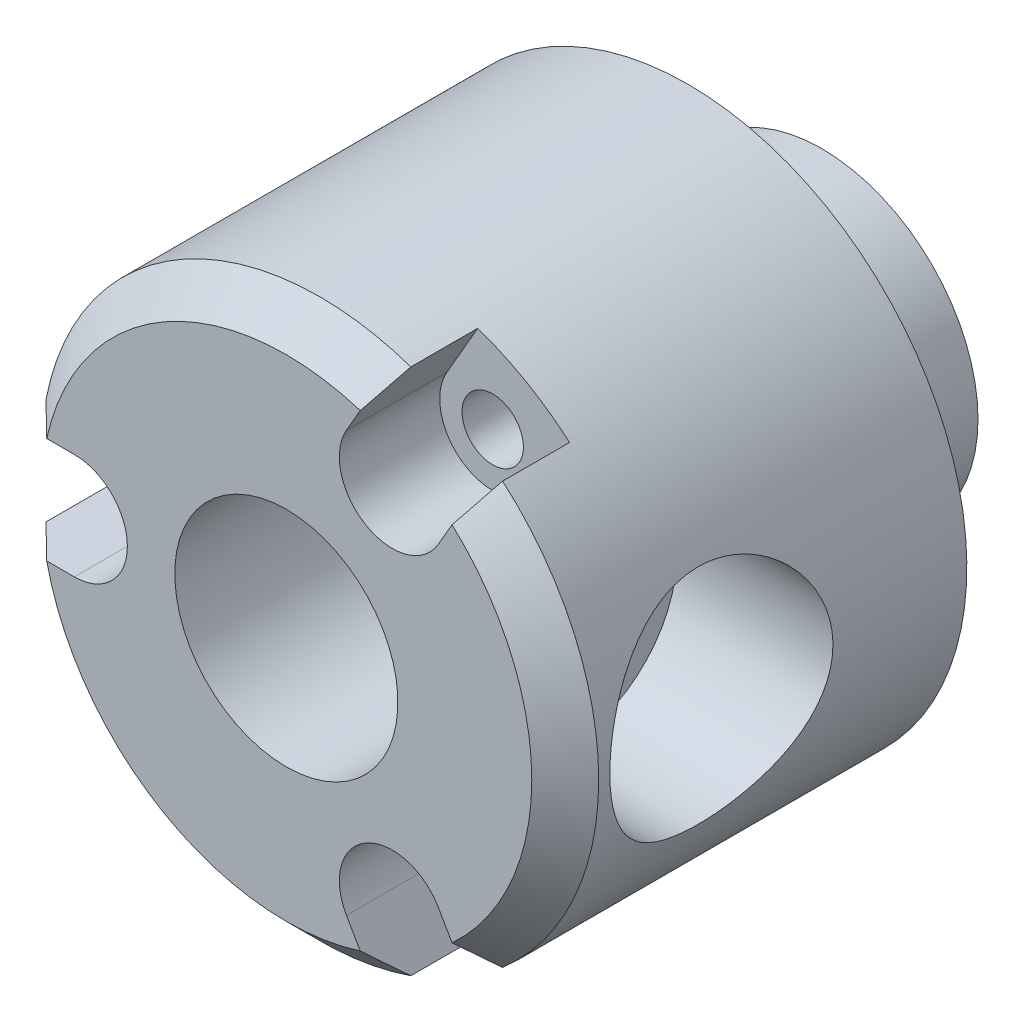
ISO-10303-21;
HEADER;
FILE_DESCRIPTION(('STEP AP214'),'2;1');
FILE_NAME('part.step','',(''),(''),'','','');
FILE_SCHEMA(('AUTOMOTIVE_DESIGN { 1 0 10303 214 1 1 1 1 }'));
ENDSEC;
DATA;
#1=APPLICATION_CONTEXT('core data for automotive mechanical design processes');
#2=APPLICATION_PROTOCOL_DEFINITION('international standard','automotive_design',2000,#1);
#3=PRODUCT_CONTEXT('',#1,'mechanical');
#4=PRODUCT('Part','Part','',(#3));
#5=PRODUCT_RELATED_PRODUCT_CATEGORY('part','',(#4));
#6=PRODUCT_DEFINITION_FORMATION('','',#4);
#7=PRODUCT_DEFINITION_CONTEXT('part definition',#1,'design');
#8=PRODUCT_DEFINITION('design','',#6,#7);
#9=PRODUCT_DEFINITION_SHAPE('','',#8);
#10=(LENGTH_UNIT() NAMED_UNIT(*) SI_UNIT(.MILLI.,.METRE.));
#11=(NAMED_UNIT(*) PLANE_ANGLE_UNIT() SI_UNIT($,.RADIAN.));
#12=(NAMED_UNIT(*) SI_UNIT($,.STERADIAN.) SOLID_ANGLE_UNIT());
#13=UNCERTAINTY_MEASURE_WITH_UNIT(LENGTH_MEASURE(1.E-05),#10,'distance_accuracy_value','');
#14=(GEOMETRIC_REPRESENTATION_CONTEXT(3) GLOBAL_UNCERTAINTY_ASSIGNED_CONTEXT((#13)) GLOBAL_UNIT_ASSIGNED_CONTEXT((#10,
#11,#12)) REPRESENTATION_CONTEXT('',''));
#15=CARTESIAN_POINT('',(0.,0.,0.));
#16=DIRECTION('',(0.,0.,1.));
#17=DIRECTION('',(1.,0.,0.));
#18=AXIS2_PLACEMENT_3D('',#15,#16,#17);
#19=CARTESIAN_POINT('',(9.49999999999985,-16.4544826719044,36.));
#20=DIRECTION('',(0.,0.,1.));
#21=DIRECTION('',(0.,-1.,0.));
#22=AXIS2_PLACEMENT_3D('',#19,#20,#21);
#23=CYLINDRICAL_SURFACE('',#22,4.75);
#24=DIRECTION('',(0.,0.,1.));
#25=VECTOR('',#24,1.);
#26=CARTESIAN_POINT('',(13.6136206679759,-14.0794826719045,27.));
#27=LINE('',#26,#25);
#28=CARTESIAN_POINT('',(13.6136206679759,-14.0794826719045,27.));
#29=VERTEX_POINT('',#28);
#30=CARTESIAN_POINT('',(13.6136206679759,-14.0794826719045,36.));
#31=VERTEX_POINT('',#30);
#32=EDGE_CURVE('E407',#29,#31,#27,.T.);
#33=ORIENTED_EDGE('',*,*,#32,.T.);
#34=CARTESIAN_POINT('',(9.49999999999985,-16.4544826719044,36.));
#35=DIRECTION('',(0.,0.,1.));
#36=DIRECTION('',(0.,-1.,0.));
#37=AXIS2_PLACEMENT_3D('',#34,#35,#36);
#38=CIRCLE('',#37,4.75);
#39=CARTESIAN_POINT('',(5.38637933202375,-18.8294826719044,36.));
#40=VERTEX_POINT('',#39);
#41=EDGE_CURVE('E186',#31,#40,#38,.T.);
#42=ORIENTED_EDGE('',*,*,#41,.T.);
#43=DIRECTION('',(0.,0.,1.));
#44=VECTOR('',#43,1.);
#45=CARTESIAN_POINT('',(5.38637933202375,-18.8294826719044,27.));
#46=LINE('',#45,#44);
#47=CARTESIAN_POINT('',(5.38637933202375,-18.8294826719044,27.));
#48=VERTEX_POINT('',#47);
#49=EDGE_CURVE('E409',#48,#40,#46,.T.);
#50=ORIENTED_EDGE('',*,*,#49,.F.);
#51=CARTESIAN_POINT('',(9.49999999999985,-16.4544826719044,27.));
#52=DIRECTION('',(0.,0.,1.));
#53=DIRECTION('',(0.,-1.,0.));
#54=AXIS2_PLACEMENT_3D('',#51,#52,#53);
#55=CIRCLE('',#54,4.75);
#56=EDGE_CURVE('E183',#29,#48,#55,.T.);
#57=ORIENTED_EDGE('',*,*,#56,.F.);
#58=EDGE_LOOP('',(#33,#42,#50,#57));
#59=FACE_BOUND('',#58,.T.);
#60=ADVANCED_FACE('F14',(#59),#23,.F.);
#61=CARTESIAN_POINT('',(9.5,16.4544826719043,36.));
#62=DIRECTION('',(0.,0.,1.));
#63=DIRECTION('',(0.,-1.,0.));
#64=AXIS2_PLACEMENT_3D('',#61,#62,#63);
#65=CYLINDRICAL_SURFACE('',#64,4.75);
#66=DIRECTION('',(0.,0.,1.));
#67=VECTOR('',#66,1.);
#68=CARTESIAN_POINT('',(5.38637933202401,18.8294826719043,27.));
#69=LINE('',#68,#67);
#70=CARTESIAN_POINT('',(5.38637933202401,18.8294826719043,27.));
#71=VERTEX_POINT('',#70);
#72=CARTESIAN_POINT('',(5.38637933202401,18.8294826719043,36.));
#73=VERTEX_POINT('',#72);
#74=EDGE_CURVE('E433',#71,#73,#69,.T.);
#75=ORIENTED_EDGE('',*,*,#74,.T.);
#76=CARTESIAN_POINT('',(9.5,16.4544826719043,36.));
#77=DIRECTION('',(0.,0.,1.));
#78=DIRECTION('',(0.,-1.,0.));
#79=AXIS2_PLACEMENT_3D('',#76,#77,#78);
#80=CIRCLE('',#79,4.75);
#81=CARTESIAN_POINT('',(13.6136206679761,14.0794826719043,36.));
#82=VERTEX_POINT('',#81);
#83=EDGE_CURVE('E196',#73,#82,#80,.T.);
#84=ORIENTED_EDGE('',*,*,#83,.T.);
#85=DIRECTION('',(0.,0.,1.));
#86=VECTOR('',#85,1.);
#87=CARTESIAN_POINT('',(13.6136206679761,14.0794826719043,27.));
#88=LINE('',#87,#86);
#89=CARTESIAN_POINT('',(13.6136206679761,14.0794826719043,27.));
#90=VERTEX_POINT('',#89);
#91=EDGE_CURVE('E432',#90,#82,#88,.T.);
#92=ORIENTED_EDGE('',*,*,#91,.F.);
#93=CARTESIAN_POINT('',(9.5,16.4544826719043,27.));
#94=DIRECTION('',(0.,0.,1.));
#95=DIRECTION('',(0.,-1.,0.));
#96=AXIS2_PLACEMENT_3D('',#93,#94,#95);
#97=CIRCLE('',#96,4.75);
#98=EDGE_CURVE('E193',#71,#90,#97,.T.);
#99=ORIENTED_EDGE('',*,*,#98,.F.);
#100=EDGE_LOOP('',(#75,#84,#92,#99));
#101=FACE_BOUND('',#100,.T.);
#102=ADVANCED_FACE('F284',(#101),#65,.F.);
#103=CARTESIAN_POINT('',(-19.,0.,36.));
#104=DIRECTION('',(0.,0.,1.));
#105=DIRECTION('',(0.,-1.,0.));
#106=AXIS2_PLACEMENT_3D('',#103,#104,#105);
#107=CYLINDRICAL_SURFACE('',#106,4.75);
#108=DIRECTION('',(0.,0.,1.));
#109=VECTOR('',#108,1.);
#110=CARTESIAN_POINT('',(-19.,-4.75,27.));
#111=LINE('',#110,#109);
#112=CARTESIAN_POINT('',(-19.,-4.75,27.));
#113=VERTEX_POINT('',#112);
#114=CARTESIAN_POINT('',(-19.,-4.75,36.));
#115=VERTEX_POINT('',#114);
#116=EDGE_CURVE('E170',#113,#115,#111,.T.);
#117=ORIENTED_EDGE('',*,*,#116,.T.);
#118=CARTESIAN_POINT('',(-19.,0.,36.));
#119=DIRECTION('',(0.,0.,1.));
#120=DIRECTION('',(0.,-1.,0.));
#121=AXIS2_PLACEMENT_3D('',#118,#119,#120);
#122=CIRCLE('',#121,4.75);
#123=CARTESIAN_POINT('',(-19.,4.75,36.));
#124=VERTEX_POINT('',#123);
#125=EDGE_CURVE('E206',#115,#124,#122,.T.);
#126=ORIENTED_EDGE('',*,*,#125,.T.);
#127=DIRECTION('',(0.,0.,1.));
#128=VECTOR('',#127,1.);
#129=CARTESIAN_POINT('',(-19.,4.75,27.));
#130=LINE('',#129,#128);
#131=CARTESIAN_POINT('',(-19.,4.75,27.));
#132=VERTEX_POINT('',#131);
#133=EDGE_CURVE('E169',#132,#124,#130,.T.);
#134=ORIENTED_EDGE('',*,*,#133,.F.);
#135=CARTESIAN_POINT('',(-19.,0.,27.));
#136=DIRECTION('',(0.,0.,1.));
#137=DIRECTION('',(0.,-1.,0.));
#138=AXIS2_PLACEMENT_3D('',#135,#136,#137);
#139=CIRCLE('',#138,4.75);
#140=EDGE_CURVE('E203',#113,#132,#139,.T.);
#141=ORIENTED_EDGE('',*,*,#140,.F.);
#142=EDGE_LOOP('',(#117,#126,#134,#141));
#143=FACE_BOUND('',#142,.T.);
#144=ADVANCED_FACE('F280',(#143),#107,.F.);
#145=CARTESIAN_POINT('',(0.,0.,0.));
#146=DIRECTION('',(0.,0.,-1.));
#147=DIRECTION('',(0.,1.,0.));
#148=AXIS2_PLACEMENT_3D('',#145,#146,#147);
#149=CYLINDRICAL_SURFACE('',#148,25.);
#150=CARTESIAN_POINT('',(0.,0.,33.));
#151=DIRECTION('',(0.,0.,-1.));
#152=DIRECTION('',(0.,1.,0.));
#153=AXIS2_PLACEMENT_3D('',#150,#151,#152);
#154=CIRCLE('',#153,25.);
#155=CARTESIAN_POINT('',(8.15868046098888,-23.6312490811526,33.));
#156=VERTEX_POINT('',#155);
#157=CARTESIAN_POINT('',(-24.5446022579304,-4.75,33.));
#158=VERTEX_POINT('',#157);
#159=EDGE_CURVE('E145',#156,#158,#154,.T.);
#160=ORIENTED_EDGE('',*,*,#159,.T.);
#161=DIRECTION('',(0.,0.,-1.));
#162=VECTOR('',#161,1.);
#163=CARTESIAN_POINT('',(-24.5446022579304,-4.75,0.));
#164=LINE('',#163,#162);
#165=CARTESIAN_POINT('',(-24.5446022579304,-4.75,27.));
#166=VERTEX_POINT('',#165);
#167=EDGE_CURVE('E177',#166,#158,#164,.F.);
#168=ORIENTED_EDGE('',*,*,#167,.F.);
#169=CARTESIAN_POINT('',(0.,0.,27.));
#170=DIRECTION('',(0.,0.,1.));
#171=DIRECTION('',(0.,-1.,0.));
#172=AXIS2_PLACEMENT_3D('',#169,#170,#171);
#173=CIRCLE('',#172,25.);
#174=CARTESIAN_POINT('',(-24.5446022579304,4.75,27.));
#175=VERTEX_POINT('',#174);
#176=EDGE_CURVE('E173',#166,#175,#173,.F.);
#177=ORIENTED_EDGE('',*,*,#176,.T.);
#178=DIRECTION('',(0.,0.,-1.));
#179=VECTOR('',#178,1.);
#180=CARTESIAN_POINT('',(-24.5446022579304,4.75,0.));
#181=LINE('',#180,#179);
#182=CARTESIAN_POINT('',(-24.5446022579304,4.75,33.));
#183=VERTEX_POINT('',#182);
#184=EDGE_CURVE('E144',#183,#175,#181,.T.);
#185=ORIENTED_EDGE('',*,*,#184,.F.);
#186=CARTESIAN_POINT('',(8.15868046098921,23.6312490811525,33.));
#187=VERTEX_POINT('',#186);
#188=EDGE_CURVE('E128',#183,#187,#154,.T.);
#189=ORIENTED_EDGE('',*,*,#188,.T.);
#190=DIRECTION('',(0.,0.,-1.));
#191=VECTOR('',#190,1.);
#192=CARTESIAN_POINT('',(8.15868046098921,23.6312490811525,0.));
#193=LINE('',#192,#191);
#194=CARTESIAN_POINT('',(8.15868046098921,23.6312490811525,27.));
#195=VERTEX_POINT('',#194);
#196=EDGE_CURVE('E142',#195,#187,#193,.F.);
#197=ORIENTED_EDGE('',*,*,#196,.F.);
#198=CARTESIAN_POINT('',(0.,0.,27.));
#199=DIRECTION('',(0.,0.,1.));
#200=DIRECTION('',(0.,-1.,0.));
#201=AXIS2_PLACEMENT_3D('',#198,#199,#200);
#202=CIRCLE('',#201,25.);
#203=CARTESIAN_POINT('',(16.3859217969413,18.8812490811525,27.));
#204=VERTEX_POINT('',#203);
#205=EDGE_CURVE('E158',#195,#204,#202,.F.);
#206=ORIENTED_EDGE('',*,*,#205,.T.);
#207=DIRECTION('',(0.,0.,-1.));
#208=VECTOR('',#207,1.);
#209=CARTESIAN_POINT('',(16.3859217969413,18.8812490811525,0.));
#210=LINE('',#209,#208);
#211=CARTESIAN_POINT('',(16.3859217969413,18.8812490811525,33.));
#212=VERTEX_POINT('',#211);
#213=EDGE_CURVE('E153',#212,#204,#210,.T.);
#214=ORIENTED_EDGE('',*,*,#213,.F.);
#215=CARTESIAN_POINT('',(16.3859217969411,-18.8812490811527,33.));
#216=VERTEX_POINT('',#215);
#217=EDGE_CURVE('E147',#212,#216,#154,.T.);
#218=ORIENTED_EDGE('',*,*,#217,.T.);
#219=DIRECTION('',(0.,0.,-1.));
#220=VECTOR('',#219,1.);
#221=CARTESIAN_POINT('',(16.3859217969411,-18.8812490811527,0.));
#222=LINE('',#221,#220);
#223=CARTESIAN_POINT('',(16.3859217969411,-18.8812490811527,27.));
#224=VERTEX_POINT('',#223);
#225=EDGE_CURVE('E420',#224,#216,#222,.F.);
#226=ORIENTED_EDGE('',*,*,#225,.F.);
#227=CARTESIAN_POINT('',(0.,0.,27.));
#228=DIRECTION('',(0.,0.,1.));
#229=DIRECTION('',(0.,-1.,0.));
#230=AXIS2_PLACEMENT_3D('',#227,#228,#229);
#231=CIRCLE('',#230,25.);
#232=CARTESIAN_POINT('',(8.15868046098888,-23.6312490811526,27.));
#233=VERTEX_POINT('',#232);
#234=EDGE_CURVE('E414',#224,#233,#231,.F.);
#235=ORIENTED_EDGE('',*,*,#234,.T.);
#236=DIRECTION('',(0.,0.,-1.));
#237=VECTOR('',#236,1.);
#238=CARTESIAN_POINT('',(8.15868046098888,-23.6312490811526,0.));
#239=LINE('',#238,#237);
#240=EDGE_CURVE('E335',#156,#233,#239,.T.);
#241=ORIENTED_EDGE('',*,*,#240,.F.);
#242=EDGE_LOOP('',(#160,#168,#177,#185,#189,#197,#206,#214,#218,#226,#235,#241));
#243=FACE_BOUND('',#242,.T.);
#244=CARTESIAN_POINT('',(22.9128784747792,10.,22.));
#245=CARTESIAN_POINT('',(22.9128805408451,9.99999793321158,22.2679432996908));
#246=CARTESIAN_POINT('',(22.9175942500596,9.98921628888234,22.5359684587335));
#247=CARTESIAN_POINT('',(22.9362975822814,9.94619451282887,23.0700814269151));
#248=CARTESIAN_POINT('',(22.9502928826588,9.9139412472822,23.3361679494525));
#249=CARTESIAN_POINT('',(22.9871287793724,9.82822912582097,23.8648801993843));
#250=CARTESIAN_POINT('',(23.0099884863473,9.77472444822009,24.1274971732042));
#251=CARTESIAN_POINT('',(23.0638014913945,9.64706427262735,24.6468219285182));
#252=CARTESIAN_POINT('',(23.0947554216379,9.57290716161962,24.9035292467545));
#253=CARTESIAN_POINT('',(23.1636467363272,9.40498076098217,25.4083461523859));
#254=CARTESIAN_POINT('',(23.2015565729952,9.31128864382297,25.6564852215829));
#255=CARTESIAN_POINT('',(23.2833138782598,9.10492212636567,26.14371867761));
#256=CARTESIAN_POINT('',(23.3271615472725,8.99224708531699,26.3828127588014));
#257=CARTESIAN_POINT('',(23.4195445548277,8.74882020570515,26.8505252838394));
#258=CARTESIAN_POINT('',(23.468077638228,8.6180770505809,27.0791486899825));
#259=CARTESIAN_POINT('',(23.5685622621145,8.33935515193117,27.5248832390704));
#260=CARTESIAN_POINT('',(23.6205150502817,8.19137010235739,27.7419901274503));
#261=CARTESIAN_POINT('',(23.7849852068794,7.70678893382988,28.3960438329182));
#262=CARTESIAN_POINT('',(23.9011684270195,7.34201789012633,28.8116724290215));
#263=CARTESIAN_POINT('',(24.1306503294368,6.54842438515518,29.5777547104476));
#264=CARTESIAN_POINT('',(24.2439479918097,6.11957963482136,29.9281856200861));
#265=CARTESIAN_POINT('',(24.4050933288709,5.42687385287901,30.4042811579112));
#266=CARTESIAN_POINT('',(24.458266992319,5.18254798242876,30.5571298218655));
#267=CARTESIAN_POINT('',(24.5592227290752,4.68080345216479,30.8415568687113));
#268=CARTESIAN_POINT('',(24.6070070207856,4.42339024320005,30.9731440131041));
#269=CARTESIAN_POINT('',(24.6958115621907,3.89719145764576,31.2138821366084));
#270=CARTESIAN_POINT('',(24.7368324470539,3.62840695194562,31.3230352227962));
#271=CARTESIAN_POINT('',(24.8109091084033,3.0813849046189,31.5178430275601));
#272=CARTESIAN_POINT('',(24.8439653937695,2.80314796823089,31.6034992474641));
#273=CARTESIAN_POINT('',(24.8997281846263,2.25304981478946,31.746825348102));
#274=CARTESIAN_POINT('',(24.9228582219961,1.98153191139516,31.8056492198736));
#275=CARTESIAN_POINT('',(24.9603502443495,1.43394947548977,31.9005550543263));
#276=CARTESIAN_POINT('',(24.9747124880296,1.15788507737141,31.9366376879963));
#277=CARTESIAN_POINT('',(24.9942540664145,0.60347278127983,31.9856518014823));
#278=CARTESIAN_POINT('',(24.9994363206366,0.325125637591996,31.998590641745));
#279=CARTESIAN_POINT('',(25.0004763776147,-0.231690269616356,32.0011911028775));
#280=CARTESIAN_POINT('',(24.9963345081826,-0.510159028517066,31.9908535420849));
#281=CARTESIAN_POINT('',(24.9793412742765,-1.04935083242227,31.9482580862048));
#282=CARTESIAN_POINT('',(24.9669929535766,-1.31019093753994,31.9172659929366));
#283=CARTESIAN_POINT('',(24.9344189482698,-1.82813508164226,31.8349721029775));
#284=CARTESIAN_POINT('',(24.9141936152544,-2.0852392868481,31.783671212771));
#285=CARTESIAN_POINT('',(24.8663734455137,-2.59398534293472,31.6612473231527));
#286=CARTESIAN_POINT('',(24.8387783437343,-2.84562699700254,31.590123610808));
#287=CARTESIAN_POINT('',(24.77689814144,-3.34183184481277,31.4286921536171));
#288=CARTESIAN_POINT('',(24.7426128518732,-3.58639483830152,31.3383838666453));
#289=CARTESIAN_POINT('',(24.667623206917,-4.07053573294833,31.1378557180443));
#290=CARTESIAN_POINT('',(24.6268311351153,-4.30998577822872,31.0273602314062));
#291=CARTESIAN_POINT('',(24.5401737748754,-4.77877806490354,30.7882052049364));
#292=CARTESIAN_POINT('',(24.494306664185,-5.00811663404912,30.6595391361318));
#293=CARTESIAN_POINT('',(24.3985896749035,-5.45537645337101,30.3849706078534));
#294=CARTESIAN_POINT('',(24.3487394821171,-5.67329680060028,30.2390667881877));
#295=CARTESIAN_POINT('',(24.2462149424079,-6.09659718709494,29.9309547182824));
#296=CARTESIAN_POINT('',(24.1935403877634,-6.30197630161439,29.7687452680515));
#297=CARTESIAN_POINT('',(24.0830694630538,-6.71221301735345,29.4178004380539));
#298=CARTESIAN_POINT('',(24.0251639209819,-6.9161504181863,29.2280225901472));
#299=CARTESIAN_POINT('',(23.9090514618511,-7.30745656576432,28.8321695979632));
#300=CARTESIAN_POINT('',(23.8508445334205,-7.49482468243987,28.6260938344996));
#301=CARTESIAN_POINT('',(23.7356723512,-7.8519473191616,28.1987488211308));
#302=CARTESIAN_POINT('',(23.6787075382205,-8.02169566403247,27.9774742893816));
#303=CARTESIAN_POINT('',(23.5676251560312,-8.34241283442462,27.5210453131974));
#304=CARTESIAN_POINT('',(23.513507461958,-8.49338248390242,27.2858914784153));
#305=CARTESIAN_POINT('',(23.4082017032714,-8.77952196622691,26.7961140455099));
#306=CARTESIAN_POINT('',(23.3571417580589,-8.91411616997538,26.541125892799));
#307=CARTESIAN_POINT('',(23.2613739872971,-9.16111521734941,26.0195989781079));
#308=CARTESIAN_POINT('',(23.2166634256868,-9.27352962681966,25.7530652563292));
#309=CARTESIAN_POINT('',(23.135121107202,-9.4751255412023,25.2102622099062));
#310=CARTESIAN_POINT('',(23.0982869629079,-9.56431408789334,24.9339958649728));
#311=CARTESIAN_POINT('',(23.0338295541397,-9.71852350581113,24.373750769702));
#312=CARTESIAN_POINT('',(23.0062055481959,-9.78354632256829,24.0897726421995));
#313=CARTESIAN_POINT('',(22.9626006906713,-9.88543600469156,23.5339616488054));
#314=CARTESIAN_POINT('',(22.9460115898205,-9.9237804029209,23.2624467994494));
#315=CARTESIAN_POINT('',(22.9224667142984,-9.97804609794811,22.7167707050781));
#316=CARTESIAN_POINT('',(22.9155105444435,-9.99396831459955,22.4426095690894));
#317=CARTESIAN_POINT('',(22.9114819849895,-10.003200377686,21.8939083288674));
#318=CARTESIAN_POINT('',(22.9144069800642,-9.99651620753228,21.6193683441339));
#319=CARTESIAN_POINT('',(22.9300298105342,-9.96062826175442,21.0720505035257));
#320=CARTESIAN_POINT('',(22.9427273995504,-9.93142505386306,20.7992726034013));
#321=CARTESIAN_POINT('',(22.9764462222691,-9.85315233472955,20.2731445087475));
#322=CARTESIAN_POINT('',(22.9969492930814,-9.80531592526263,20.0195761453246));
#323=CARTESIAN_POINT('',(23.0456142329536,-9.69038472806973,19.517503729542));
#324=CARTESIAN_POINT('',(23.0737787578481,-9.62328326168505,19.2690014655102));
#325=CARTESIAN_POINT('',(23.1369260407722,-9.47045293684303,18.7787520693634));
#326=CARTESIAN_POINT('',(23.1719073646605,-9.3847279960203,18.5370035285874));
#327=CARTESIAN_POINT('',(23.2477235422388,-9.19531146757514,18.0615011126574));
#328=CARTESIAN_POINT('',(23.2885606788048,-9.09161286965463,17.8277503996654));
#329=CARTESIAN_POINT('',(23.3767257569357,-8.86252494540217,17.3603803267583));
#330=CARTESIAN_POINT('',(23.4242483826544,-8.73643228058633,17.1271425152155));
#331=CARTESIAN_POINT('',(23.5231622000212,-8.46649303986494,16.6719084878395));
#332=CARTESIAN_POINT('',(23.5745550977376,-8.3226386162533,16.4499173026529));
#333=CARTESIAN_POINT('',(23.6798634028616,-8.01810592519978,16.0183843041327));
#334=CARTESIAN_POINT('',(23.7337791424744,-7.85742543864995,15.8088441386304));
#335=CARTESIAN_POINT('',(23.8427852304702,-7.52017263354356,15.4032913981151));
#336=CARTESIAN_POINT('',(23.8978756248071,-7.34359969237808,15.207279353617));
#337=CARTESIAN_POINT('',(24.0119837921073,-6.96183884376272,14.8157821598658));
#338=CARTESIAN_POINT('',(24.0709898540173,-6.75549995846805,14.6214139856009));
#339=CARTESIAN_POINT('',(24.1871909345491,-6.32685407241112,14.2507304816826));
#340=CARTESIAN_POINT('',(24.2443865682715,-6.10455258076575,14.0744089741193));
#341=CARTESIAN_POINT('',(24.3554653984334,-5.64510225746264,13.7408571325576));
#342=CARTESIAN_POINT('',(24.4093470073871,-5.40794641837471,13.5836359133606));
#343=CARTESIAN_POINT('',(24.512272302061,-4.92042054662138,13.2896353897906));
#344=CARTESIAN_POINT('',(24.5613180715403,-4.67005627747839,13.1528472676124));
#345=CARTESIAN_POINT('',(24.6532357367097,-4.15761008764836,12.9007796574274));
#346=CARTESIAN_POINT('',(24.6961073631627,-3.89552765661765,12.7855011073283));
#347=CARTESIAN_POINT('',(24.7744510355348,-3.3614587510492,12.577542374));
#348=CARTESIAN_POINT('',(24.8099230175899,-3.08947219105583,12.4848623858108));
#349=CARTESIAN_POINT('',(24.8724119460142,-2.53774672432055,12.3230974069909));
#350=CARTESIAN_POINT('',(24.8994326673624,-2.25801133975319,12.2540018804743));
#351=CARTESIAN_POINT('',(24.9442251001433,-1.69291011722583,12.1401260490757));
#352=CARTESIAN_POINT('',(24.9619974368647,-1.40754466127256,12.0953441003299));
#353=CARTESIAN_POINT('',(24.9869097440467,-0.852327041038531,12.0327326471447));
#354=CARTESIAN_POINT('',(24.9946681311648,-0.582678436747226,12.0133343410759));
#355=CARTESIAN_POINT('',(25.0014220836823,-0.0425920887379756,11.996442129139));
#356=CARTESIAN_POINT('',(25.0004180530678,0.227845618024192,11.998947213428));
#357=CARTESIAN_POINT('',(24.9896755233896,0.767415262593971,12.0258317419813));
#358=CARTESIAN_POINT('',(24.9799382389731,1.03654737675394,12.0502081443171));
#359=CARTESIAN_POINT('',(24.9519951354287,1.5715226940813,12.1205717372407));
#360=CARTESIAN_POINT('',(24.9337893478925,1.8373659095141,12.16655884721));
#361=CARTESIAN_POINT('',(24.8900859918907,2.35566546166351,12.2779161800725));
#362=CARTESIAN_POINT('',(24.8648318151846,2.60828137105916,12.3426417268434));
#363=CARTESIAN_POINT('',(24.8074428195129,3.1070604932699,12.4913762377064));
#364=CARTESIAN_POINT('',(24.7753055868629,3.35322140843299,12.5753919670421));
#365=CARTESIAN_POINT('',(24.7049318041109,3.83747450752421,12.761974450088));
#366=CARTESIAN_POINT('',(24.6666957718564,4.07556737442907,12.8645396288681));
#367=CARTESIAN_POINT('',(24.5850167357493,4.54236828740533,13.0874359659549));
#368=CARTESIAN_POINT('',(24.54157332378,4.77107559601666,13.2077685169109));
#369=CARTESIAN_POINT('',(24.4484634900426,5.2277440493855,13.4710382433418));
#370=CARTESIAN_POINT('',(24.3986069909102,5.45522634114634,13.614738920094));
#371=CARTESIAN_POINT('',(24.2955251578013,5.89737222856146,13.9195844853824));
#372=CARTESIAN_POINT('',(24.2422997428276,6.11203551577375,14.0807297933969));
#373=CARTESIAN_POINT('',(24.133751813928,6.52749120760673,14.4195165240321));
#374=CARTESIAN_POINT('',(24.0784285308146,6.72827844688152,14.5971640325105));
#375=CARTESIAN_POINT('',(23.967048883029,7.11484620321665,14.9678818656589));
#376=CARTESIAN_POINT('',(23.910992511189,7.30062657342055,15.1609523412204));
#377=CARTESIAN_POINT('',(23.7960585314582,7.6672528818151,15.5739482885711));
#378=CARTESIAN_POINT('',(23.7372222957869,7.84707327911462,15.7947971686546));
#379=CARTESIAN_POINT('',(23.6219835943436,8.18744004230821,16.251358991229));
#380=CARTESIAN_POINT('',(23.5655803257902,8.34799279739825,16.4870669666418));
#381=CARTESIAN_POINT('',(23.4568451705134,8.64881574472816,16.9721313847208));
#382=CARTESIAN_POINT('',(23.4045149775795,8.78907751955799,17.2214934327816));
#383=CARTESIAN_POINT('',(23.3056049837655,9.04809415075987,17.7322196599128));
#384=CARTESIAN_POINT('',(23.2590243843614,9.16685199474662,17.9935821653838));
#385=CARTESIAN_POINT('',(23.1770166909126,9.37213926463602,18.5026543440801));
#386=CARTESIAN_POINT('',(23.1409637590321,9.46060466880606,18.7494838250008));
#387=CARTESIAN_POINT('',(23.0759605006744,9.61807222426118,19.2501755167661));
#388=CARTESIAN_POINT('',(23.0470093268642,9.68707669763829,19.5040368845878));
#389=CARTESIAN_POINT('',(22.9971568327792,9.80483861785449,20.0165393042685));
#390=CARTESIAN_POINT('',(22.9762363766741,9.85364421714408,20.2751674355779));
#391=CARTESIAN_POINT('',(22.9430254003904,9.93072834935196,20.7959074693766));
#392=CARTESIAN_POINT('',(22.9307298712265,9.95901879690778,21.0580172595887));
#393=CARTESIAN_POINT('',(22.9195922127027,9.98460530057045,21.4338753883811));
#394=CARTESIAN_POINT('',(22.9170765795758,9.9903763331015,21.546999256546));
#395=CARTESIAN_POINT('',(22.9137192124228,9.99807426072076,21.7734105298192));
#396=CARTESIAN_POINT('',(22.912877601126,10.0000008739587,21.8866979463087));
#397=CARTESIAN_POINT('',(22.9128784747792,10.,22.));
#398=B_SPLINE_CURVE_WITH_KNOTS('',3,(#244,#245,#246,#247,#248,#249,#250,#251,#252,#253,#254,
#255,#256,#257,#258,#259,#260,#261,#262,#263,#264,#265,#266,#267,#268,#269,#270,#271,#272,#273,
#274,#275,#276,#277,#278,#279,#280,#281,#282,#283,#284,#285,#286,#287,#288,#289,#290,#291,#292,
#293,#294,#295,#296,#297,#298,#299,#300,#301,#302,#303,#304,#305,#306,#307,#308,#309,#310,#311,
#312,#313,#314,#315,#316,#317,#318,#319,#320,#321,#322,#323,#324,#325,#326,#327,#328,#329,#330,
#331,#332,#333,#334,#335,#336,#337,#338,#339,#340,#341,#342,#343,#344,#345,#346,#347,#348,#349,
#350,#351,#352,#353,#354,#355,#356,#357,#358,#359,#360,#361,#362,#363,#364,#365,#366,#367,#368,
#369,#370,#371,#372,#373,#374,#375,#376,#377,#378,#379,#380,#381,#382,#383,#384,#385,#386,#387,
#388,#389,#390,#391,#392,#393,#394,#395,#396,#397),.UNSPECIFIED.,.T.,.F.,(4,2,2,2,2,2,2,2,2,2,2,
2,2,2,2,2,2,2,2,2,2,2,2,2,2,2,2,2,2,2,2,2,2,2,2,2,2,2,2,2,2,2,2,2,2,2,2,2,2,2,2,2,2,2,2,2,2,2,2,
2,2,2,2,2,2,2,2,2,2,2,2,2,2,2,2,2,4),(0.,0.803715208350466,1.60792248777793,2.41387327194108,
3.21988702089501,4.02277500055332,4.82569008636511,5.62822062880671,6.43104561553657,
8.11835508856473,9.8062528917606,10.6844970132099,11.5623782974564,12.4401770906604,
13.3179197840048,14.1531749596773,14.9884054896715,15.8233703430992,16.658305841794,
17.4462735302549,18.2342060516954,19.0221669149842,19.8101500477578,20.6098280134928,
21.4097940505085,22.2098232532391,23.0099113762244,23.8625484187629,24.7152178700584,
25.5681851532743,26.4211149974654,27.2984479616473,28.1754017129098,29.0520892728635,
29.9287062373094,30.7517641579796,31.5747883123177,32.3975946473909,33.2203802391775,
33.9960599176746,34.7720088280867,35.5477946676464,36.32388377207,37.1311108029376,
37.9386957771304,38.7463873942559,39.5541106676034,40.42173174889,41.2890548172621,
42.1567901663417,43.0241499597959,43.8915475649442,44.7589526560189,45.6259697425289,
46.4929282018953,47.3032840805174,48.1136025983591,48.9238084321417,49.734011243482,
50.5191121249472,51.3044887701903,52.0897987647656,52.8751703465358,53.6952201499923,
54.5152896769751,55.3356628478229,56.1560440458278,57.0274489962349,57.8985641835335,
58.7700397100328,59.6413940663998,60.4345380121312,61.2275872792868,62.0187349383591,
62.8094227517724,63.1492555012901,63.4891131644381),.UNSPECIFIED.);
#399=CARTESIAN_POINT('',(22.9128784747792,10.,22.));
#400=VERTEX_POINT('',#399);
#401=EDGE_CURVE('E29',#400,#400,#398,.T.);
#402=ORIENTED_EDGE('',*,*,#401,.F.);
#403=EDGE_LOOP('',(#402));
#404=FACE_BOUND('',#403,.T.);
#405=CARTESIAN_POINT('',(0.,0.,0.));
#406=DIRECTION('',(0.,0.,-1.));
#407=DIRECTION('',(0.,1.,0.));
#408=AXIS2_PLACEMENT_3D('',#405,#406,#407);
#409=CIRCLE('',#408,25.);
#410=CARTESIAN_POINT('',(0.,25.,0.));
#411=VERTEX_POINT('',#410);
#412=EDGE_CURVE('E231',#411,#411,#409,.T.);
#413=ORIENTED_EDGE('',*,*,#412,.F.);
#414=EDGE_LOOP('',(#413));
#415=FACE_BOUND('',#414,.T.);
#416=ADVANCED_FACE('F16',(#243,#404,#415),#149,.T.);
#417=CARTESIAN_POINT('',(14.,0.,0.));
#418=DIRECTION('',(0.,0.,-1.));
#419=DIRECTION('',(0.,1.,0.));
#420=AXIS2_PLACEMENT_3D('',#417,#418,#419);
#421=PLANE('',#420);
#422=CARTESIAN_POINT('',(9.49999999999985,-16.4544826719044,0.));
#423=DIRECTION('',(0.,0.,-1.));
#424=DIRECTION('',(0.,1.,0.));
#425=AXIS2_PLACEMENT_3D('',#422,#423,#424);
#426=CIRCLE('',#425,2.75);
#427=CARTESIAN_POINT('',(9.49999999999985,-13.7044826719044,0.));
#428=VERTEX_POINT('',#427);
#429=EDGE_CURVE('E189',#428,#428,#426,.T.);
#430=ORIENTED_EDGE('',*,*,#429,.F.);
#431=EDGE_LOOP('',(#430));
#432=FACE_BOUND('',#431,.T.);
#433=CARTESIAN_POINT('',(9.5,16.4544826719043,0.));
#434=DIRECTION('',(0.,0.,-1.));
#435=DIRECTION('',(0.,1.,0.));
#436=AXIS2_PLACEMENT_3D('',#433,#434,#435);
#437=CIRCLE('',#436,2.75);
#438=CARTESIAN_POINT('',(9.5,19.2044826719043,0.));
#439=VERTEX_POINT('',#438);
#440=EDGE_CURVE('E199',#439,#439,#437,.T.);
#441=ORIENTED_EDGE('',*,*,#440,.F.);
#442=EDGE_LOOP('',(#441));
#443=FACE_BOUND('',#442,.T.);
#444=CARTESIAN_POINT('',(-19.,0.,0.));
#445=DIRECTION('',(0.,0.,-1.));
#446=DIRECTION('',(0.,1.,0.));
#447=AXIS2_PLACEMENT_3D('',#444,#445,#446);
#448=CIRCLE('',#447,2.75);
#449=CARTESIAN_POINT('',(-19.,2.75,0.));
#450=VERTEX_POINT('',#449);
#451=EDGE_CURVE('E209',#450,#450,#448,.T.);
#452=ORIENTED_EDGE('',*,*,#451,.F.);
#453=EDGE_LOOP('',(#452));
#454=FACE_BOUND('',#453,.T.);
#455=ORIENTED_EDGE('',*,*,#412,.T.);
#456=EDGE_LOOP('',(#455));
#457=FACE_BOUND('',#456,.T.);
#458=CARTESIAN_POINT('',(0.,0.,0.));
#459=DIRECTION('',(0.,0.,-1.));
#460=DIRECTION('',(0.,1.,0.));
#461=AXIS2_PLACEMENT_3D('',#458,#459,#460);
#462=CIRCLE('',#461,14.);
#463=CARTESIAN_POINT('',(0.,14.,0.));
#464=VERTEX_POINT('',#463);
#465=EDGE_CURVE('E228',#464,#464,#462,.T.);
#466=ORIENTED_EDGE('',*,*,#465,.F.);
#467=EDGE_LOOP('',(#466));
#468=FACE_BOUND('',#467,.T.);
#469=ADVANCED_FACE('F271',(#432,#443,#454,#457,#468),#421,.T.);
#470=CARTESIAN_POINT('',(0.,0.,0.));
#471=DIRECTION('',(0.,0.,-1.));
#472=DIRECTION('',(0.,1.,0.));
#473=AXIS2_PLACEMENT_3D('',#470,#471,#472);
#474=CYLINDRICAL_SURFACE('',#473,14.);
#475=ORIENTED_EDGE('',*,*,#465,.T.);
#476=EDGE_LOOP('',(#475));
#477=FACE_BOUND('',#476,.T.);
#478=CARTESIAN_POINT('',(0.,0.,-12.));
#479=DIRECTION('',(0.,0.,-1.));
#480=DIRECTION('',(0.,1.,0.));
#481=AXIS2_PLACEMENT_3D('',#478,#479,#480);
#482=CIRCLE('',#481,14.);
#483=CARTESIAN_POINT('',(0.,14.,-12.));
#484=VERTEX_POINT('',#483);
#485=EDGE_CURVE('E225',#484,#484,#482,.T.);
#486=ORIENTED_EDGE('',*,*,#485,.F.);
#487=EDGE_LOOP('',(#486));
#488=FACE_BOUND('',#487,.T.);
#489=ADVANCED_FACE('F268',(#477,#488),#474,.T.);
#490=CARTESIAN_POINT('',(14.,0.,-12.));
#491=DIRECTION('',(0.,0.,-1.));
#492=DIRECTION('',(0.,1.,0.));
#493=AXIS2_PLACEMENT_3D('',#490,#491,#492);
#494=PLANE('',#493);
#495=ORIENTED_EDGE('',*,*,#485,.T.);
#496=EDGE_LOOP('',(#495));
#497=FACE_BOUND('',#496,.T.);
#498=CARTESIAN_POINT('',(0.,0.,-12.));
#499=DIRECTION('',(0.,0.,-1.));
#500=DIRECTION('',(0.,1.,0.));
#501=AXIS2_PLACEMENT_3D('',#498,#499,#500);
#502=CIRCLE('',#501,10.5);
#503=CARTESIAN_POINT('',(0.,10.5,-12.));
#504=VERTEX_POINT('',#503);
#505=EDGE_CURVE('E222',#504,#504,#502,.T.);
#506=ORIENTED_EDGE('',*,*,#505,.F.);
#507=EDGE_LOOP('',(#506));
#508=FACE_BOUND('',#507,.T.);
#509=ADVANCED_FACE('F264',(#497,#508),#494,.T.);
#510=CARTESIAN_POINT('',(0.,0.,0.));
#511=DIRECTION('',(0.,0.,-1.));
#512=DIRECTION('',(0.,1.,0.));
#513=AXIS2_PLACEMENT_3D('',#510,#511,#512);
#514=CYLINDRICAL_SURFACE('',#513,10.5);
#515=ORIENTED_EDGE('',*,*,#505,.T.);
#516=EDGE_LOOP('',(#515));
#517=FACE_BOUND('',#516,.T.);
#518=CARTESIAN_POINT('',(0.,0.,6.));
#519=DIRECTION('',(0.,0.,-1.));
#520=DIRECTION('',(0.,1.,0.));
#521=AXIS2_PLACEMENT_3D('',#518,#519,#520);
#522=CIRCLE('',#521,10.5);
#523=CARTESIAN_POINT('',(0.,10.5,6.));
#524=VERTEX_POINT('',#523);
#525=EDGE_CURVE('E219',#524,#524,#522,.T.);
#526=ORIENTED_EDGE('',*,*,#525,.F.);
#527=EDGE_LOOP('',(#526));
#528=FACE_BOUND('',#527,.T.);
#529=ADVANCED_FACE('F260',(#517,#528),#514,.F.);
#530=CARTESIAN_POINT('',(10.,0.,6.));
#531=DIRECTION('',(0.,0.,-1.));
#532=DIRECTION('',(0.,1.,0.));
#533=AXIS2_PLACEMENT_3D('',#530,#531,#532);
#534=PLANE('',#533);
#535=ORIENTED_EDGE('',*,*,#525,.T.);
#536=EDGE_LOOP('',(#535));
#537=FACE_BOUND('',#536,.T.);
#538=CARTESIAN_POINT('',(0.,0.,6.));
#539=DIRECTION('',(0.,0.,-1.));
#540=DIRECTION('',(0.,1.,0.));
#541=AXIS2_PLACEMENT_3D('',#538,#539,#540);
#542=CIRCLE('',#541,10.);
#543=CARTESIAN_POINT('',(0.,10.,6.));
#544=VERTEX_POINT('',#543);
#545=EDGE_CURVE('E216',#544,#544,#542,.T.);
#546=ORIENTED_EDGE('',*,*,#545,.F.);
#547=EDGE_LOOP('',(#546));
#548=FACE_BOUND('',#547,.T.);
#549=ADVANCED_FACE('F256',(#537,#548),#534,.T.);
#550=CARTESIAN_POINT('',(0.,0.,0.));
#551=DIRECTION('',(0.,0.,-1.));
#552=DIRECTION('',(0.,1.,0.));
#553=AXIS2_PLACEMENT_3D('',#550,#551,#552);
#554=CYLINDRICAL_SURFACE('',#553,10.);
#555=CARTESIAN_POINT('',(0.,0.,36.));
#556=DIRECTION('',(0.,0.,-1.));
#557=DIRECTION('',(0.,1.,0.));
#558=AXIS2_PLACEMENT_3D('',#555,#556,#557);
#559=CIRCLE('',#558,10.);
#560=CARTESIAN_POINT('',(0.,10.,36.));
#561=VERTEX_POINT('',#560);
#562=EDGE_CURVE('E213',#561,#561,#559,.T.);
#563=ORIENTED_EDGE('',*,*,#562,.F.);
#564=EDGE_LOOP('',(#563));
#565=FACE_BOUND('',#564,.T.);
#566=ORIENTED_EDGE('',*,*,#545,.T.);
#567=EDGE_LOOP('',(#566));
#568=FACE_BOUND('',#567,.T.);
#569=ADVANCED_FACE('F252',(#565,#568),#554,.F.);
#570=CARTESIAN_POINT('',(10.,0.,36.));
#571=DIRECTION('',(0.,0.,1.));
#572=DIRECTION('',(0.,-1.,0.));
#573=AXIS2_PLACEMENT_3D('',#570,#571,#572);
#574=PLANE('',#573);
#575=ORIENTED_EDGE('',*,*,#562,.T.);
#576=EDGE_LOOP('',(#575));
#577=FACE_BOUND('',#576,.T.);
#578=CARTESIAN_POINT('',(0.,0.,36.));
#579=DIRECTION('',(0.,0.,-1.));
#580=DIRECTION('',(0.,1.,0.));
#581=AXIS2_PLACEMENT_3D('',#578,#579,#580);
#582=CIRCLE('',#581,22.);
#583=CARTESIAN_POINT('',(-21.4810963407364,4.75,36.));
#584=VERTEX_POINT('',#583);
#585=CARTESIAN_POINT('',(6.62692750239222,20.9781751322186,36.));
#586=VERTEX_POINT('',#585);
#587=EDGE_CURVE('E36',#584,#586,#582,.T.);
#588=ORIENTED_EDGE('',*,*,#587,.F.);
#589=DIRECTION('',(-1.,0.,0.));
#590=VECTOR('',#589,1.);
#591=CARTESIAN_POINT('',(-19.,4.75,36.));
#592=LINE('',#591,#590);
#593=EDGE_CURVE('E152',#124,#584,#592,.T.);
#594=ORIENTED_EDGE('',*,*,#593,.F.);
#595=ORIENTED_EDGE('',*,*,#125,.F.);
#596=DIRECTION('',(1.,0.,0.));
#597=VECTOR('',#596,1.);
#598=CARTESIAN_POINT('',(-19.,-4.75,36.));
#599=LINE('',#598,#597);
#600=CARTESIAN_POINT('',(-21.4810963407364,-4.75,36.));
#601=VERTEX_POINT('',#600);
#602=EDGE_CURVE('E156',#601,#115,#599,.T.);
#603=ORIENTED_EDGE('',*,*,#602,.F.);
#604=CARTESIAN_POINT('',(6.62692750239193,-20.9781751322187,36.));
#605=VERTEX_POINT('',#604);
#606=EDGE_CURVE('E340',#605,#601,#582,.T.);
#607=ORIENTED_EDGE('',*,*,#606,.F.);
#608=DIRECTION('',(0.499999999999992,-0.866025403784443,0.));
#609=VECTOR('',#608,1.);
#610=CARTESIAN_POINT('',(5.38637933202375,-18.8294826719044,36.));
#611=LINE('',#610,#609);
#612=EDGE_CURVE('E449',#40,#605,#611,.T.);
#613=ORIENTED_EDGE('',*,*,#612,.F.);
#614=ORIENTED_EDGE('',*,*,#41,.F.);
#615=DIRECTION('',(-0.499999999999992,0.866025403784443,0.));
#616=VECTOR('',#615,1.);
#617=CARTESIAN_POINT('',(13.6136206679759,-14.0794826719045,36.));
#618=LINE('',#617,#616);
#619=CARTESIAN_POINT('',(14.8541688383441,-16.2281751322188,36.));
#620=VERTEX_POINT('',#619);
#621=EDGE_CURVE('E448',#620,#31,#618,.T.);
#622=ORIENTED_EDGE('',*,*,#621,.F.);
#623=CARTESIAN_POINT('',(14.8541688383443,16.2281751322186,36.));
#624=VERTEX_POINT('',#623);
#625=EDGE_CURVE('E44',#624,#620,#582,.T.);
#626=ORIENTED_EDGE('',*,*,#625,.F.);
#627=DIRECTION('',(0.5,0.866025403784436,0.));
#628=VECTOR('',#627,1.);
#629=CARTESIAN_POINT('',(13.6136206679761,14.0794826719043,36.));
#630=LINE('',#629,#628);
#631=EDGE_CURVE('E423',#82,#624,#630,.T.);
#632=ORIENTED_EDGE('',*,*,#631,.F.);
#633=ORIENTED_EDGE('',*,*,#83,.F.);
#634=DIRECTION('',(-0.5,-0.866025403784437,0.));
#635=VECTOR('',#634,1.);
#636=CARTESIAN_POINT('',(5.38637933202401,18.8294826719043,36.));
#637=LINE('',#636,#635);
#638=EDGE_CURVE('E426',#586,#73,#637,.T.);
#639=ORIENTED_EDGE('',*,*,#638,.F.);
#640=EDGE_LOOP('',(#588,#594,#595,#603,#607,#613,#614,#622,#626,#632,#633,#639));
#641=FACE_BOUND('',#640,.T.);
#642=ADVANCED_FACE('F247',(#577,#641),#574,.T.);
#643=CARTESIAN_POINT('',(11.,0.,22.));
#644=DIRECTION('',(1.,0.,0.));
#645=DIRECTION('',(0.,1.,0.));
#646=AXIS2_PLACEMENT_3D('',#643,#644,#645);
#647=CYLINDRICAL_SURFACE('',#646,10.);
#648=ORIENTED_EDGE('',*,*,#401,.T.);
#649=EDGE_LOOP('',(#648));
#650=FACE_BOUND('',#649,.T.);
#651=CARTESIAN_POINT('',(11.,0.,22.));
#652=DIRECTION('',(1.,0.,0.));
#653=DIRECTION('',(0.,1.,0.));
#654=AXIS2_PLACEMENT_3D('',#651,#652,#653);
#655=CIRCLE('',#654,10.);
#656=CARTESIAN_POINT('',(11.,10.,22.));
#657=VERTEX_POINT('',#656);
#658=EDGE_CURVE('E210',#657,#657,#655,.T.);
#659=ORIENTED_EDGE('',*,*,#658,.F.);
#660=EDGE_LOOP('',(#659));
#661=FACE_BOUND('',#660,.T.);
#662=ADVANCED_FACE('F241',(#650,#661),#647,.F.);
#663=CARTESIAN_POINT('',(11.,0.,22.));
#664=DIRECTION('',(1.,0.,0.));
#665=DIRECTION('',(0.,1.,0.));
#666=AXIS2_PLACEMENT_3D('',#663,#664,#665);
#667=PLANE('',#666);
#668=ORIENTED_EDGE('',*,*,#658,.T.);
#669=EDGE_LOOP('',(#668));
#670=FACE_BOUND('',#669,.T.);
#671=ADVANCED_FACE('F246',(#670),#667,.T.);
#672=CARTESIAN_POINT('',(-16.25,0.,27.));
#673=DIRECTION('',(0.,0.,-1.));
#674=DIRECTION('',(0.,1.,0.));
#675=AXIS2_PLACEMENT_3D('',#672,#673,#674);
#676=PLANE('',#675);
#677=CARTESIAN_POINT('',(-19.,0.,27.));
#678=DIRECTION('',(0.,0.,1.));
#679=DIRECTION('',(0.,-1.,0.));
#680=AXIS2_PLACEMENT_3D('',#677,#678,#679);
#681=CIRCLE('',#680,2.75);
#682=CARTESIAN_POINT('',(-19.,-2.75,27.));
#683=VERTEX_POINT('',#682);
#684=EDGE_CURVE('E200',#683,#683,#681,.T.);
#685=ORIENTED_EDGE('',*,*,#684,.F.);
#686=EDGE_LOOP('',(#685));
#687=FACE_BOUND('',#686,.T.);
#688=ORIENTED_EDGE('',*,*,#140,.T.);
#689=DIRECTION('',(-1.,0.,0.));
#690=VECTOR('',#689,1.);
#691=CARTESIAN_POINT('',(-19.,4.75,27.));
#692=LINE('',#691,#690);
#693=EDGE_CURVE('E163',#132,#175,#692,.T.);
#694=ORIENTED_EDGE('',*,*,#693,.T.);
#695=ORIENTED_EDGE('',*,*,#176,.F.);
#696=DIRECTION('',(1.,0.,0.));
#697=VECTOR('',#696,1.);
#698=CARTESIAN_POINT('',(-19.,-4.75,27.));
#699=LINE('',#698,#697);
#700=EDGE_CURVE('E166',#166,#113,#699,.T.);
#701=ORIENTED_EDGE('',*,*,#700,.T.);
#702=EDGE_LOOP('',(#688,#694,#695,#701));
#703=FACE_BOUND('',#702,.T.);
#704=ADVANCED_FACE('F309',(#687,#703),#676,.F.);
#705=CARTESIAN_POINT('',(-19.,0.,36.));
#706=DIRECTION('',(0.,0.,1.));
#707=DIRECTION('',(0.,-1.,0.));
#708=AXIS2_PLACEMENT_3D('',#705,#706,#707);
#709=CYLINDRICAL_SURFACE('',#708,2.75);
#710=ORIENTED_EDGE('',*,*,#451,.T.);
#711=EDGE_LOOP('',(#710));
#712=FACE_BOUND('',#711,.T.);
#713=ORIENTED_EDGE('',*,*,#684,.T.);
#714=EDGE_LOOP('',(#713));
#715=FACE_BOUND('',#714,.T.);
#716=ADVANCED_FACE('F304',(#712,#715),#709,.F.);
#717=CARTESIAN_POINT('',(12.25,16.4544826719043,27.));
#718=DIRECTION('',(0.,0.,-1.));
#719=DIRECTION('',(0.,1.,0.));
#720=AXIS2_PLACEMENT_3D('',#717,#718,#719);
#721=PLANE('',#720);
#722=CARTESIAN_POINT('',(9.5,16.4544826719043,27.));
#723=DIRECTION('',(0.,0.,1.));
#724=DIRECTION('',(0.,-1.,0.));
#725=AXIS2_PLACEMENT_3D('',#722,#723,#724);
#726=CIRCLE('',#725,2.75);
#727=CARTESIAN_POINT('',(9.5,13.7044826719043,27.));
#728=VERTEX_POINT('',#727);
#729=EDGE_CURVE('E190',#728,#728,#726,.T.);
#730=ORIENTED_EDGE('',*,*,#729,.F.);
#731=EDGE_LOOP('',(#730));
#732=FACE_BOUND('',#731,.T.);
#733=ORIENTED_EDGE('',*,*,#98,.T.);
#734=DIRECTION('',(0.5,0.866025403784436,0.));
#735=VECTOR('',#734,1.);
#736=CARTESIAN_POINT('',(13.6136206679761,14.0794826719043,27.));
#737=LINE('',#736,#735);
#738=EDGE_CURVE('E428',#90,#204,#737,.T.);
#739=ORIENTED_EDGE('',*,*,#738,.T.);
#740=ORIENTED_EDGE('',*,*,#205,.F.);
#741=DIRECTION('',(-0.5,-0.866025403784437,0.));
#742=VECTOR('',#741,1.);
#743=CARTESIAN_POINT('',(5.38637933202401,18.8294826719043,27.));
#744=LINE('',#743,#742);
#745=EDGE_CURVE('E151',#195,#71,#744,.T.);
#746=ORIENTED_EDGE('',*,*,#745,.T.);
#747=EDGE_LOOP('',(#733,#739,#740,#746));
#748=FACE_BOUND('',#747,.T.);
#749=ADVANCED_FACE('F301',(#732,#748),#721,.F.);
#750=CARTESIAN_POINT('',(9.5,16.4544826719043,36.));
#751=DIRECTION('',(0.,0.,1.));
#752=DIRECTION('',(0.,-1.,0.));
#753=AXIS2_PLACEMENT_3D('',#750,#751,#752);
#754=CYLINDRICAL_SURFACE('',#753,2.75);
#755=ORIENTED_EDGE('',*,*,#440,.T.);
#756=EDGE_LOOP('',(#755));
#757=FACE_BOUND('',#756,.T.);
#758=ORIENTED_EDGE('',*,*,#729,.T.);
#759=EDGE_LOOP('',(#758));
#760=FACE_BOUND('',#759,.T.);
#761=ADVANCED_FACE('F298',(#757,#760),#754,.F.);
#762=CARTESIAN_POINT('',(12.2499999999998,-16.4544826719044,27.));
#763=DIRECTION('',(0.,0.,-1.));
#764=DIRECTION('',(0.,1.,0.));
#765=AXIS2_PLACEMENT_3D('',#762,#763,#764);
#766=PLANE('',#765);
#767=CARTESIAN_POINT('',(9.49999999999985,-16.4544826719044,27.));
#768=DIRECTION('',(0.,0.,1.));
#769=DIRECTION('',(0.,-1.,0.));
#770=AXIS2_PLACEMENT_3D('',#767,#768,#769);
#771=CIRCLE('',#770,2.75);
#772=CARTESIAN_POINT('',(9.49999999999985,-19.2044826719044,27.));
#773=VERTEX_POINT('',#772);
#774=EDGE_CURVE('E180',#773,#773,#771,.T.);
#775=ORIENTED_EDGE('',*,*,#774,.F.);
#776=EDGE_LOOP('',(#775));
#777=FACE_BOUND('',#776,.T.);
#778=ORIENTED_EDGE('',*,*,#56,.T.);
#779=DIRECTION('',(0.499999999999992,-0.866025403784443,0.));
#780=VECTOR('',#779,1.);
#781=CARTESIAN_POINT('',(5.38637933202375,-18.8294826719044,27.));
#782=LINE('',#781,#780);
#783=EDGE_CURVE('E403',#48,#233,#782,.T.);
#784=ORIENTED_EDGE('',*,*,#783,.T.);
#785=ORIENTED_EDGE('',*,*,#234,.F.);
#786=DIRECTION('',(-0.499999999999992,0.866025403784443,0.));
#787=VECTOR('',#786,1.);
#788=CARTESIAN_POINT('',(13.6136206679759,-14.0794826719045,27.));
#789=LINE('',#788,#787);
#790=EDGE_CURVE('E405',#224,#29,#789,.T.);
#791=ORIENTED_EDGE('',*,*,#790,.T.);
#792=EDGE_LOOP('',(#778,#784,#785,#791));
#793=FACE_BOUND('',#792,.T.);
#794=ADVANCED_FACE('F296',(#777,#793),#766,.F.);
#795=CARTESIAN_POINT('',(9.49999999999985,-16.4544826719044,36.));
#796=DIRECTION('',(0.,0.,1.));
#797=DIRECTION('',(0.,-1.,0.));
#798=AXIS2_PLACEMENT_3D('',#795,#796,#797);
#799=CYLINDRICAL_SURFACE('',#798,2.75);
#800=ORIENTED_EDGE('',*,*,#429,.T.);
#801=EDGE_LOOP('',(#800));
#802=FACE_BOUND('',#801,.T.);
#803=ORIENTED_EDGE('',*,*,#774,.T.);
#804=EDGE_LOOP('',(#803));
#805=FACE_BOUND('',#804,.T.);
#806=ADVANCED_FACE('F387',(#802,#805),#799,.F.);
#807=CARTESIAN_POINT('',(-19.,-4.75,27.));
#808=DIRECTION('',(0.,-1.,0.));
#809=DIRECTION('',(1.,0.,0.));
#810=AXIS2_PLACEMENT_3D('',#807,#808,#809);
#811=PLANE('',#810);
#812=ORIENTED_EDGE('',*,*,#167,.T.);
#813=CARTESIAN_POINT('',(-32.679669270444,-4.75,24.9769280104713));
#814=CARTESIAN_POINT('',(-31.9424583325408,-4.75,25.7064588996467));
#815=CARTESIAN_POINT('',(-31.2050051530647,-4.75,26.435745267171));
#816=CARTESIAN_POINT('',(-29.729467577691,-4.75,27.8936785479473));
#817=CARTESIAN_POINT('',(-28.9913831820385,-4.75,28.6223254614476));
#818=CARTESIAN_POINT('',(-27.5144487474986,-4.75,30.0788172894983));
#819=CARTESIAN_POINT('',(-26.7755987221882,-4.75,30.8066622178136));
#820=CARTESIAN_POINT('',(-25.2969066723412,-4.75,32.2613453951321));
#821=CARTESIAN_POINT('',(-24.5570646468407,-4.75,32.9881836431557));
#822=CARTESIAN_POINT('',(-23.076081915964,-4.75,34.4405630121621));
#823=CARTESIAN_POINT('',(-22.3349411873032,-4.75,35.166104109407));
#824=CARTESIAN_POINT('',(-20.8509570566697,-4.75,36.6154403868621));
#825=CARTESIAN_POINT('',(-20.1081136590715,-4.75,37.3392355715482));
#826=CARTESIAN_POINT('',(-18.9920846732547,-4.75,38.423126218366));
#827=CARTESIAN_POINT('',(-18.6197775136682,-4.75,38.7841261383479));
#828=CARTESIAN_POINT('',(-17.8744636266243,-4.75,39.5054026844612));
#829=CARTESIAN_POINT('',(-17.5014568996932,-4.75,39.8656793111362));
#830=CARTESIAN_POINT('',(-16.7546062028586,-4.75,40.5853705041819));
#831=CARTESIAN_POINT('',(-16.3807622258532,-4.75,40.9447850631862));
#832=CARTESIAN_POINT('',(-15.6320506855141,-4.75,41.6625482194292));
#833=CARTESIAN_POINT('',(-15.257183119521,-4.75,42.0208968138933));
#834=CARTESIAN_POINT('',(-14.8817099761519,-4.75,42.3786110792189));
#835=B_SPLINE_CURVE_WITH_KNOTS('',3,(#813,#814,#815,#816,#817,#818,#819,#820,#821,#822,#823,
#824,#825,#826,#827,#828,#829,#830,#831,#832,#833,#834),.UNSPECIFIED.,.F.,.F.,(4,2,2,2,2,2,2,2,
2,2,4),(0.,3.11147215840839,6.22294310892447,9.33435979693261,12.4457795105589,15.5572555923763,
18.6687236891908,20.2244870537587,21.7802492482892,23.3360246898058,24.8918041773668),.UNSPECIFIED.);
#836=EDGE_CURVE('E377',#158,#601,#835,.T.);
#837=ORIENTED_EDGE('',*,*,#836,.T.);
#838=ORIENTED_EDGE('',*,*,#602,.T.);
#839=ORIENTED_EDGE('',*,*,#116,.F.);
#840=ORIENTED_EDGE('',*,*,#700,.F.);
#841=EDGE_LOOP('',(#812,#837,#838,#839,#840));
#842=FACE_BOUND('',#841,.T.);
#843=ADVANCED_FACE('F331',(#842),#811,.F.);
#844=CARTESIAN_POINT('',(-19.,4.75,27.));
#845=DIRECTION('',(0.,1.,0.));
#846=DIRECTION('',(-1.,0.,0.));
#847=AXIS2_PLACEMENT_3D('',#844,#845,#846);
#848=PLANE('',#847);
#849=ORIENTED_EDGE('',*,*,#593,.T.);
#850=CARTESIAN_POINT('',(-14.8817099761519,4.75,42.3786110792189));
#851=CARTESIAN_POINT('',(-15.257183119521,4.75,42.0208968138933));
#852=CARTESIAN_POINT('',(-15.6320506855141,4.75,41.6625482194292));
#853=CARTESIAN_POINT('',(-16.3807622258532,4.75,40.9447850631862));
#854=CARTESIAN_POINT('',(-16.7546062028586,4.75,40.5853705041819));
#855=CARTESIAN_POINT('',(-17.5014568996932,4.75,39.8656793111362));
#856=CARTESIAN_POINT('',(-17.8744636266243,4.75,39.5054026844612));
#857=CARTESIAN_POINT('',(-18.6197775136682,4.75,38.7841261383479));
#858=CARTESIAN_POINT('',(-18.9920846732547,4.75,38.423126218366));
#859=CARTESIAN_POINT('',(-20.1081136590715,4.75,37.3392355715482));
#860=CARTESIAN_POINT('',(-20.8509570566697,4.75,36.6154403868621));
#861=CARTESIAN_POINT('',(-22.3349411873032,4.75,35.166104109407));
#862=CARTESIAN_POINT('',(-23.076081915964,4.75,34.4405630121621));
#863=CARTESIAN_POINT('',(-24.5570646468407,4.75,32.9881836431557));
#864=CARTESIAN_POINT('',(-25.2969066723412,4.75,32.2613453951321));
#865=CARTESIAN_POINT('',(-26.7755987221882,4.75,30.8066622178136));
#866=CARTESIAN_POINT('',(-27.5144487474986,4.75,30.0788172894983));
#867=CARTESIAN_POINT('',(-28.9913831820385,4.75,28.6223254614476));
#868=CARTESIAN_POINT('',(-29.729467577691,4.75,27.8936785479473));
#869=CARTESIAN_POINT('',(-31.2050051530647,4.75,26.435745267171));
#870=CARTESIAN_POINT('',(-31.9424583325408,4.75,25.7064588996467));
#871=CARTESIAN_POINT('',(-32.679669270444,4.75,24.9769280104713));
#872=B_SPLINE_CURVE_WITH_KNOTS('',3,(#850,#851,#852,#853,#854,#855,#856,#857,#858,#859,#860,
#861,#862,#863,#864,#865,#866,#867,#868,#869,#870,#871),.UNSPECIFIED.,.F.,.F.,(4,2,2,2,2,2,2,2,
2,2,4),(0.,1.55577948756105,3.11155492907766,4.66731712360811,6.22308048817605,9.33454858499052,
12.446024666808,15.5574443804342,18.6688610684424,21.7803320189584,24.8918041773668),.UNSPECIFIED.);
#873=EDGE_CURVE('E133',#584,#183,#872,.T.);
#874=ORIENTED_EDGE('',*,*,#873,.T.);
#875=ORIENTED_EDGE('',*,*,#184,.T.);
#876=ORIENTED_EDGE('',*,*,#693,.F.);
#877=ORIENTED_EDGE('',*,*,#133,.T.);
#878=EDGE_LOOP('',(#849,#874,#875,#876,#877));
#879=FACE_BOUND('',#878,.T.);
#880=ADVANCED_FACE('F328',(#879),#848,.F.);
#881=CARTESIAN_POINT('',(5.38637933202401,18.8294826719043,27.));
#882=DIRECTION('',(-0.866025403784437,0.5,0.));
#883=DIRECTION('',(-0.5,-0.866025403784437,0.));
#884=AXIS2_PLACEMENT_3D('',#881,#882,#883);
#885=PLANE('',#884);
#886=ORIENTED_EDGE('',*,*,#196,.T.);
#887=CARTESIAN_POINT('',(8.15878231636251,23.6314254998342,32.9998));
#888=CARTESIAN_POINT('',(8.03127935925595,23.4105839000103,33.2501602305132));
#889=CARTESIAN_POINT('',(7.90374148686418,23.1896818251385,33.5004493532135));
#890=CARTESIAN_POINT('',(7.64858848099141,22.747743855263,34.0008697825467));
#891=CARTESIAN_POINT('',(7.52097334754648,22.5267079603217,34.2510010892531));
#892=CARTESIAN_POINT('',(7.26565825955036,22.0844892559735,34.7510905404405));
#893=CARTESIAN_POINT('',(7.13795830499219,21.8633064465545,35.0010486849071));
#894=CARTESIAN_POINT('',(6.88246442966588,21.4207780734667,35.5007730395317));
#895=CARTESIAN_POINT('',(6.7546705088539,21.1994325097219,35.7505392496));
#896=CARTESIAN_POINT('',(6.62682508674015,20.9779977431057,36.0002));
#897=B_SPLINE_CURVE_WITH_KNOTS('',3,(#887,#888,#889,#890,#891,#892,#893,#894,#895,#896),
.UNSPECIFIED.,.F.,.F.,(4,2,2,2,4),(0.,1.072088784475,2.14417706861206,3.21626544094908,
4.28835431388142),.UNSPECIFIED.);
#898=EDGE_CURVE('E125',#187,#586,#897,.T.);
#899=ORIENTED_EDGE('',*,*,#898,.T.);
#900=ORIENTED_EDGE('',*,*,#638,.T.);
#901=ORIENTED_EDGE('',*,*,#74,.F.);
#902=ORIENTED_EDGE('',*,*,#745,.F.);
#903=EDGE_LOOP('',(#886,#899,#900,#901,#902));
#904=FACE_BOUND('',#903,.T.);
#905=ADVANCED_FACE('F149',(#904),#885,.F.);
#906=CARTESIAN_POINT('',(13.6136206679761,14.0794826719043,27.));
#907=DIRECTION('',(0.866025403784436,-0.5,0.));
#908=DIRECTION('',(0.5,0.866025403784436,0.));
#909=AXIS2_PLACEMENT_3D('',#906,#907,#908);
#910=PLANE('',#909);
#911=ORIENTED_EDGE('',*,*,#631,.T.);
#912=CARTESIAN_POINT('',(14.8540664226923,16.2279977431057,36.0002));
#913=CARTESIAN_POINT('',(14.981911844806,16.4494325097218,35.7505392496));
#914=CARTESIAN_POINT('',(15.109705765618,16.6707780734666,35.5007730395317));
#915=CARTESIAN_POINT('',(15.3651996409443,17.1133064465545,35.0010486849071));
#916=CARTESIAN_POINT('',(15.4928995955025,17.3344892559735,34.7510905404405));
#917=CARTESIAN_POINT('',(15.7482146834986,17.7767079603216,34.2510010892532));
#918=CARTESIAN_POINT('',(15.8758298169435,17.9977438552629,34.0008697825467));
#919=CARTESIAN_POINT('',(16.1309828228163,18.4396818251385,33.5004493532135));
#920=CARTESIAN_POINT('',(16.2585206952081,18.6605839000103,33.2501602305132));
#921=CARTESIAN_POINT('',(16.3860236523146,18.8814254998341,32.9998));
#922=B_SPLINE_CURVE_WITH_KNOTS('',3,(#912,#913,#914,#915,#916,#917,#918,#919,#920,#921),
.UNSPECIFIED.,.F.,.F.,(4,2,2,2,4),(0.,1.07208887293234,2.14417724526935,3.21626552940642,
4.28835431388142),.UNSPECIFIED.);
#923=EDGE_CURVE('E134',#624,#212,#922,.T.);
#924=ORIENTED_EDGE('',*,*,#923,.T.);
#925=ORIENTED_EDGE('',*,*,#213,.T.);
#926=ORIENTED_EDGE('',*,*,#738,.F.);
#927=ORIENTED_EDGE('',*,*,#91,.T.);
#928=EDGE_LOOP('',(#911,#924,#925,#926,#927));
#929=FACE_BOUND('',#928,.T.);
#930=ADVANCED_FACE('F441',(#929),#910,.F.);
#931=CARTESIAN_POINT('',(13.6136206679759,-14.0794826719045,27.));
#932=DIRECTION('',(0.866025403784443,0.499999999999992,0.));
#933=DIRECTION('',(-0.499999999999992,0.866025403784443,0.));
#934=AXIS2_PLACEMENT_3D('',#931,#932,#933);
#935=PLANE('',#934);
#936=ORIENTED_EDGE('',*,*,#225,.T.);
#937=CARTESIAN_POINT('',(16.3860236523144,-18.8814254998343,32.9998));
#938=CARTESIAN_POINT('',(16.2585206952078,-18.6605839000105,33.2501602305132));
#939=CARTESIAN_POINT('',(16.1309828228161,-18.4396818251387,33.5004493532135));
#940=CARTESIAN_POINT('',(15.8758298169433,-17.9977438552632,34.0008697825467));
#941=CARTESIAN_POINT('',(15.7482146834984,-17.7767079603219,34.2510010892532));
#942=CARTESIAN_POINT('',(15.4928995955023,-17.3344892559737,34.7510905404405));
#943=CARTESIAN_POINT('',(15.3651996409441,-17.1133064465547,35.0010486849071));
#944=CARTESIAN_POINT('',(15.1097057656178,-16.6707780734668,35.5007730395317));
#945=CARTESIAN_POINT('',(14.9819118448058,-16.449432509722,35.7505392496));
#946=CARTESIAN_POINT('',(14.854066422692,-16.2279977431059,36.0002));
#947=B_SPLINE_CURVE_WITH_KNOTS('',3,(#937,#938,#939,#940,#941,#942,#943,#944,#945,#946),
.UNSPECIFIED.,.F.,.F.,(4,2,2,2,4),(0.,1.07208878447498,2.14417706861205,3.21626544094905,
4.28835431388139),.UNSPECIFIED.);
#948=EDGE_CURVE('E341',#216,#620,#947,.T.);
#949=ORIENTED_EDGE('',*,*,#948,.T.);
#950=ORIENTED_EDGE('',*,*,#621,.T.);
#951=ORIENTED_EDGE('',*,*,#32,.F.);
#952=ORIENTED_EDGE('',*,*,#790,.F.);
#953=EDGE_LOOP('',(#936,#949,#950,#951,#952));
#954=FACE_BOUND('',#953,.T.);
#955=ADVANCED_FACE('F353',(#954),#935,.F.);
#956=CARTESIAN_POINT('',(5.38637933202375,-18.8294826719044,27.));
#957=DIRECTION('',(-0.866025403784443,-0.499999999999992,0.));
#958=DIRECTION('',(0.499999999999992,-0.866025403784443,0.));
#959=AXIS2_PLACEMENT_3D('',#956,#957,#958);
#960=PLANE('',#959);
#961=ORIENTED_EDGE('',*,*,#612,.T.);
#962=CARTESIAN_POINT('',(6.62682508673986,-20.9779977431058,36.0002));
#963=CARTESIAN_POINT('',(6.7546705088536,-21.199432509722,35.7505392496));
#964=CARTESIAN_POINT('',(6.88246442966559,-21.4207780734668,35.5007730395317));
#965=CARTESIAN_POINT('',(7.13795830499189,-21.8633064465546,35.0010486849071));
#966=CARTESIAN_POINT('',(7.26565825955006,-22.0844892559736,34.7510905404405));
#967=CARTESIAN_POINT('',(7.52097334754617,-22.5267079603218,34.2510010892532));
#968=CARTESIAN_POINT('',(7.6485884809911,-22.7477438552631,34.0008697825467));
#969=CARTESIAN_POINT('',(7.90374148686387,-23.1896818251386,33.5004493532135));
#970=CARTESIAN_POINT('',(8.03127935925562,-23.4105839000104,33.2501602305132));
#971=CARTESIAN_POINT('',(8.15878231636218,-23.6314254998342,32.9998));
#972=B_SPLINE_CURVE_WITH_KNOTS('',3,(#962,#963,#964,#965,#966,#967,#968,#969,#970,#971),
.UNSPECIFIED.,.F.,.F.,(4,2,2,2,4),(0.,1.07208887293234,2.14417724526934,3.21626552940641,
4.2883543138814),.UNSPECIFIED.);
#973=EDGE_CURVE('E9',#605,#156,#972,.T.);
#974=ORIENTED_EDGE('',*,*,#973,.T.);
#975=ORIENTED_EDGE('',*,*,#240,.T.);
#976=ORIENTED_EDGE('',*,*,#783,.F.);
#977=ORIENTED_EDGE('',*,*,#49,.T.);
#978=EDGE_LOOP('',(#961,#974,#975,#976,#977));
#979=FACE_BOUND('',#978,.T.);
#980=ADVANCED_FACE('F359',(#979),#960,.F.);
#981=CARTESIAN_POINT('',(0.,0.,36.));
#982=DIRECTION('',(0.,0.,-1.));
#983=DIRECTION('',(0.,1.,0.));
#984=AXIS2_PLACEMENT_3D('',#981,#982,#983);
#985=CONICAL_SURFACE('',#984,22.,0.785398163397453);
#986=ORIENTED_EDGE('',*,*,#159,.F.);
#987=ORIENTED_EDGE('',*,*,#973,.F.);
#988=ORIENTED_EDGE('',*,*,#606,.T.);
#989=ORIENTED_EDGE('',*,*,#836,.F.);
#990=EDGE_LOOP('',(#986,#987,#988,#989));
#991=FACE_BOUND('',#990,.T.);
#992=ADVANCED_FACE('F355',(#991),#985,.T.);
#993=ORIENTED_EDGE('',*,*,#625,.T.);
#994=ORIENTED_EDGE('',*,*,#948,.F.);
#995=ORIENTED_EDGE('',*,*,#217,.F.);
#996=ORIENTED_EDGE('',*,*,#923,.F.);
#997=EDGE_LOOP('',(#993,#994,#995,#996));
#998=FACE_BOUND('',#997,.T.);
#999=ADVANCED_FACE('F358',(#998),#985,.T.);
#1000=ORIENTED_EDGE('',*,*,#587,.T.);
#1001=ORIENTED_EDGE('',*,*,#898,.F.);
#1002=ORIENTED_EDGE('',*,*,#188,.F.);
#1003=ORIENTED_EDGE('',*,*,#873,.F.);
#1004=EDGE_LOOP('',(#1000,#1001,#1002,#1003));
#1005=FACE_BOUND('',#1004,.T.);
#1006=ADVANCED_FACE('F127',(#1005),#985,.T.);
#1007=CLOSED_SHELL('',(#60,#102,#144,#416,#469,#489,#509,#529,#549,#569,#642,#662,#671,#704,
#716,#749,#761,#794,#806,#843,#880,#905,#930,#955,#980,#992,#999,#1006));
#1008=MANIFOLD_SOLID_BREP('B1',#1007);
#1009=ADVANCED_BREP_SHAPE_REPRESENTATION('',(#18,#1008),#14);
#1010=SHAPE_DEFINITION_REPRESENTATION(#9,#1009);
ENDSEC;
END-ISO-10303-21;
